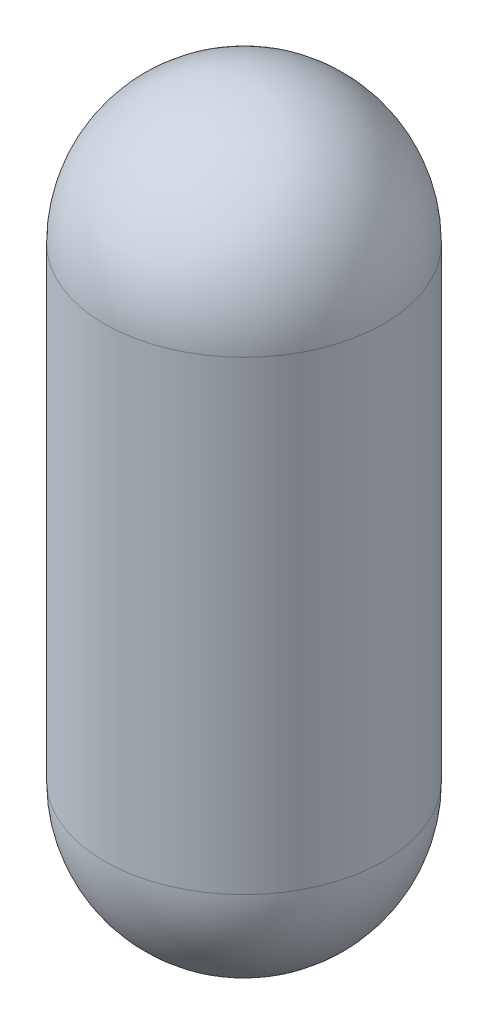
ISO-10303-21;
HEADER;
FILE_DESCRIPTION(('STEP AP214'),'2;1');
FILE_NAME('part.step','',(''),(''),'','','');
FILE_SCHEMA(('AUTOMOTIVE_DESIGN { 1 0 10303 214 1 1 1 1 }'));
ENDSEC;
DATA;
#1=APPLICATION_CONTEXT('core data for automotive mechanical design processes');
#2=APPLICATION_PROTOCOL_DEFINITION('international standard','automotive_design',2000,#1);
#3=PRODUCT_CONTEXT('',#1,'mechanical');
#4=PRODUCT('Part','Part','',(#3));
#5=PRODUCT_RELATED_PRODUCT_CATEGORY('part','',(#4));
#6=PRODUCT_DEFINITION_FORMATION('','',#4);
#7=PRODUCT_DEFINITION_CONTEXT('part definition',#1,'design');
#8=PRODUCT_DEFINITION('design','',#6,#7);
#9=PRODUCT_DEFINITION_SHAPE('','',#8);
#10=(LENGTH_UNIT() NAMED_UNIT(*) SI_UNIT(.MILLI.,.METRE.));
#11=(NAMED_UNIT(*) PLANE_ANGLE_UNIT() SI_UNIT($,.RADIAN.));
#12=(NAMED_UNIT(*) SI_UNIT($,.STERADIAN.) SOLID_ANGLE_UNIT());
#13=UNCERTAINTY_MEASURE_WITH_UNIT(LENGTH_MEASURE(1.E-05),#10,'distance_accuracy_value','');
#14=(GEOMETRIC_REPRESENTATION_CONTEXT(3) GLOBAL_UNCERTAINTY_ASSIGNED_CONTEXT((#13)) GLOBAL_UNIT_ASSIGNED_CONTEXT((#10,
#11,#12)) REPRESENTATION_CONTEXT('',''));
#15=CARTESIAN_POINT('',(0.,0.,0.));
#16=DIRECTION('',(0.,0.,1.));
#17=DIRECTION('',(1.,0.,0.));
#18=AXIS2_PLACEMENT_3D('',#15,#16,#17);
#19=CARTESIAN_POINT('',(-50.,-147.5,0.));
#20=DIRECTION('',(0.,1.,0.));
#21=DIRECTION('',(0.,0.,-1.));
#22=AXIS2_PLACEMENT_3D('',#19,#20,#21);
#23=CYLINDRICAL_SURFACE('',#22,1.5);
#24=CARTESIAN_POINT('',(-50.,-142.5,0.));
#25=DIRECTION('',(0.,1.,0.));
#26=DIRECTION('',(-1.,0.,0.));
#27=AXIS2_PLACEMENT_3D('',#24,#25,#26);
#28=CIRCLE('',#27,1.5);
#29=CARTESIAN_POINT('',(-50.,-142.5,-1.5));
#30=VERTEX_POINT('',#29);
#31=CARTESIAN_POINT('',(-50.,-142.5,1.5));
#32=VERTEX_POINT('',#31);
#33=EDGE_CURVE('E11',#30,#32,#28,.T.);
#34=ORIENTED_EDGE('',*,*,#33,.F.);
#35=CARTESIAN_POINT('',(-50.,-142.5,0.));
#36=DIRECTION('',(0.,-1.,0.));
#37=DIRECTION('',(1.,0.,0.));
#38=AXIS2_PLACEMENT_3D('',#35,#36,#37);
#39=CIRCLE('',#38,1.5);
#40=EDGE_CURVE('E24',#30,#32,#39,.T.);
#41=ORIENTED_EDGE('',*,*,#40,.T.);
#42=EDGE_LOOP('',(#34,#41));
#43=FACE_BOUND('',#42,.T.);
#44=CARTESIAN_POINT('',(-50.,-147.5,0.));
#45=DIRECTION('',(0.,1.,0.));
#46=DIRECTION('',(-1.,0.,0.));
#47=AXIS2_PLACEMENT_3D('',#44,#45,#46);
#48=CIRCLE('',#47,1.5);
#49=CARTESIAN_POINT('',(-50.,-147.5,-1.5));
#50=VERTEX_POINT('',#49);
#51=CARTESIAN_POINT('',(-50.,-147.5,1.5));
#52=VERTEX_POINT('',#51);
#53=EDGE_CURVE('E42',#50,#52,#48,.T.);
#54=ORIENTED_EDGE('',*,*,#53,.T.);
#55=CARTESIAN_POINT('',(-50.,-147.5,0.));
#56=DIRECTION('',(0.,-1.,0.));
#57=DIRECTION('',(1.,0.,0.));
#58=AXIS2_PLACEMENT_3D('',#55,#56,#57);
#59=CIRCLE('',#58,1.5);
#60=EDGE_CURVE('E30',#50,#52,#59,.T.);
#61=ORIENTED_EDGE('',*,*,#60,.F.);
#62=EDGE_LOOP('',(#54,#61));
#63=FACE_BOUND('',#62,.T.);
#64=ADVANCED_FACE('F16',(#43,#63),#23,.T.);
#65=CARTESIAN_POINT('',(-50.,-142.5,0.));
#66=DIRECTION('',(0.,0.,1.));
#67=DIRECTION('',(-1.,0.,0.));
#68=AXIS2_PLACEMENT_3D('',#65,#66,#67);
#69=SPHERICAL_SURFACE('',#68,1.5);
#70=CARTESIAN_POINT('',(-50.,-142.5,0.));
#71=DIRECTION('',(0.,1.,0.));
#72=DIRECTION('',(-1.,0.,0.));
#73=AXIS2_PLACEMENT_3D('',#70,#71,#72);
#74=SPHERICAL_SURFACE('',#73,1.5);
#75=ORIENTED_EDGE('',*,*,#33,.T.);
#76=ORIENTED_EDGE('',*,*,#40,.F.);
#77=EDGE_LOOP('',(#75,#76));
#78=FACE_BOUND('',#77,.T.);
#79=ADVANCED_FACE('F80',(#78),#74,.T.);
#80=CARTESIAN_POINT('',(-50.,-147.5,0.));
#81=DIRECTION('',(0.,0.,1.));
#82=DIRECTION('',(1.,0.,0.));
#83=AXIS2_PLACEMENT_3D('',#80,#81,#82);
#84=SPHERICAL_SURFACE('',#83,1.5);
#85=CARTESIAN_POINT('',(-50.,-147.5,0.));
#86=DIRECTION('',(0.,-1.,0.));
#87=DIRECTION('',(1.,0.,0.));
#88=AXIS2_PLACEMENT_3D('',#85,#86,#87);
#89=SPHERICAL_SURFACE('',#88,1.5);
#90=ORIENTED_EDGE('',*,*,#60,.T.);
#91=ORIENTED_EDGE('',*,*,#53,.F.);
#92=EDGE_LOOP('',(#90,#91));
#93=FACE_BOUND('',#92,.T.);
#94=ADVANCED_FACE('F41',(#93),#89,.T.);
#95=CLOSED_SHELL('',(#64,#79,#94));
#96=MANIFOLD_SOLID_BREP('B1',#95);
#97=ADVANCED_BREP_SHAPE_REPRESENTATION('',(#18,#96),#14);
#98=SHAPE_DEFINITION_REPRESENTATION(#9,#97);
ENDSEC;
END-ISO-10303-21;
